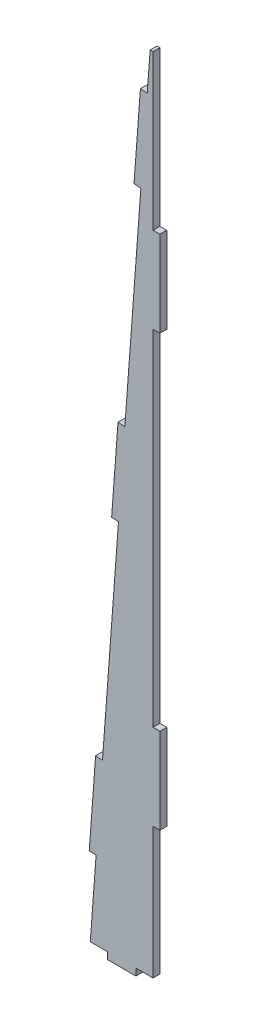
from build123d import *

# Parameters (mm, degrees)
BOSS_EXTRUDE1_DEPTH = 1.524


with BuildPart() as part:
    # Sketch1 → Boss-Extrude1 (new body)
    with BuildSketch(Plane.XY):
        Polygon((-1.524, 145.513267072), (0, 145.513267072), (0, 126.463267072), (-1.524, 126.463267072), (-1.524, 49.888686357), (0, 49.888686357), (0, 30.838686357), (-1.524, 30.838686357), (-1.524, 1.659768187), (-5.319834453, 1.659768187), (-5.319834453, 0.135768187), (-11.669834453, 0.135768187), (-11.669834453, 1.659768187), (-15.465668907, 1.659768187), (-14.176326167, 18.940550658), (-15.696101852, 19.053943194), (-14.278695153, 38.051139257), (-12.758919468, 37.937746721), (-9.203537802, 85.589759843), (-10.723313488, 85.703152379), (-9.305906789, 104.700348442), (-7.786131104, 104.586955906), (-4.230749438, 152.238969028), (-5.750525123, 152.352361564), (-4.333118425, 171.349557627), (-2.81334274, 171.236165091), (-2.16867137, 179.876556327), (-1.524, 179.876556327), align=None)
    extrude(amount=BOSS_EXTRUDE1_DEPTH)


solid = part.part
